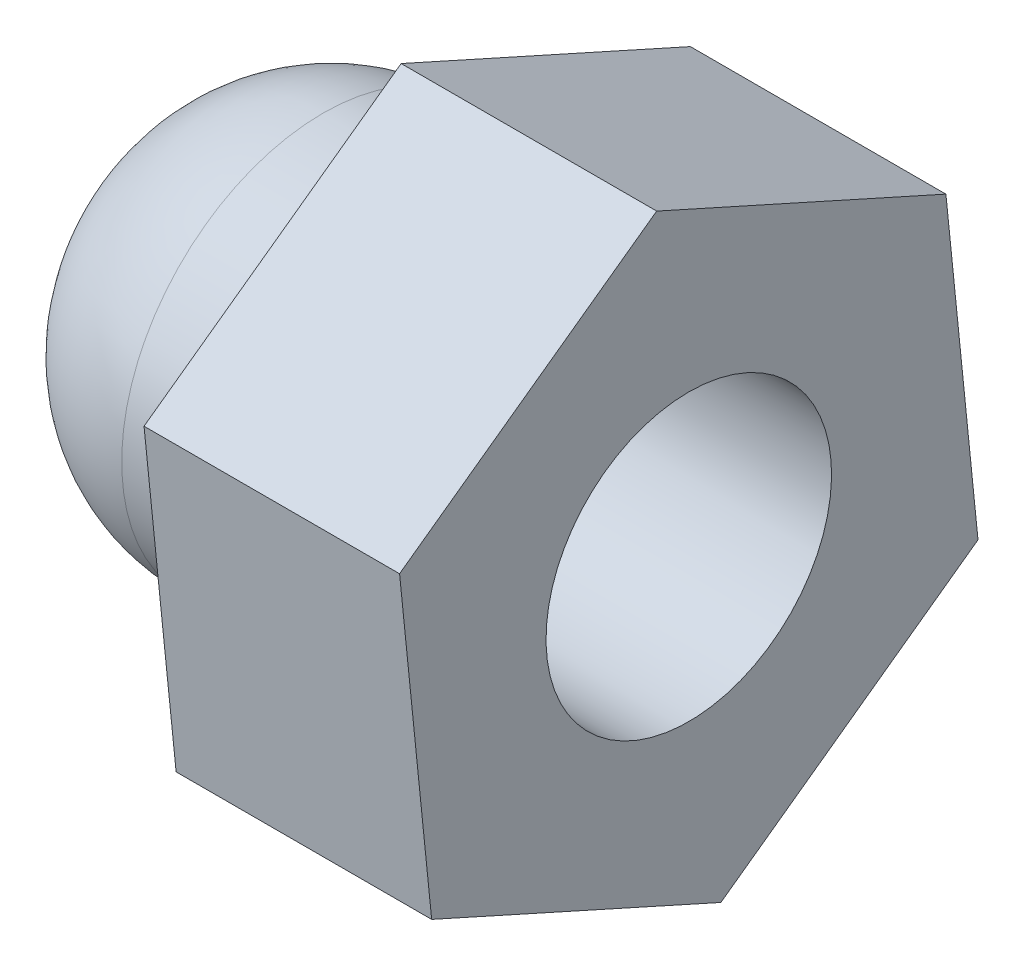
ISO-10303-21;
HEADER;
FILE_DESCRIPTION(('STEP AP214'),'2;1');
FILE_NAME('part.step','',(''),(''),'','','');
FILE_SCHEMA(('AUTOMOTIVE_DESIGN { 1 0 10303 214 1 1 1 1 }'));
ENDSEC;
DATA;
#1=APPLICATION_CONTEXT('core data for automotive mechanical design processes');
#2=APPLICATION_PROTOCOL_DEFINITION('international standard','automotive_design',2000,#1);
#3=PRODUCT_CONTEXT('',#1,'mechanical');
#4=PRODUCT('Part','Part','',(#3));
#5=PRODUCT_RELATED_PRODUCT_CATEGORY('part','',(#4));
#6=PRODUCT_DEFINITION_FORMATION('','',#4);
#7=PRODUCT_DEFINITION_CONTEXT('part definition',#1,'design');
#8=PRODUCT_DEFINITION('design','',#6,#7);
#9=PRODUCT_DEFINITION_SHAPE('','',#8);
#10=(LENGTH_UNIT() NAMED_UNIT(*) SI_UNIT(.MILLI.,.METRE.));
#11=(NAMED_UNIT(*) PLANE_ANGLE_UNIT() SI_UNIT($,.RADIAN.));
#12=(NAMED_UNIT(*) SI_UNIT($,.STERADIAN.) SOLID_ANGLE_UNIT());
#13=UNCERTAINTY_MEASURE_WITH_UNIT(LENGTH_MEASURE(1.E-05),#10,'distance_accuracy_value','');
#14=(GEOMETRIC_REPRESENTATION_CONTEXT(3) GLOBAL_UNCERTAINTY_ASSIGNED_CONTEXT((#13)) GLOBAL_UNIT_ASSIGNED_CONTEXT((#10,
#11,#12)) REPRESENTATION_CONTEXT('',''));
#15=CARTESIAN_POINT('',(0.,0.,0.));
#16=DIRECTION('',(0.,0.,1.));
#17=DIRECTION('',(1.,0.,0.));
#18=AXIS2_PLACEMENT_3D('',#15,#16,#17);
#19=CARTESIAN_POINT('',(1769.87503334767,2148.17169398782,1.72917236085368E-11));
#20=DIRECTION('',(-1.,0.,0.));
#21=DIRECTION('',(0.,-1.,0.));
#22=AXIS2_PLACEMENT_3D('',#19,#20,#21);
#23=DEGENERATE_TOROIDAL_SURFACE('',#22,0.499999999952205,4.99999999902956,.T.);
#24=CARTESIAN_POINT('',(1764.88091590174,2148.17169398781,2.04697370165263E-11));
#25=DIRECTION('',(-1.,0.,0.));
#26=DIRECTION('',(0.,-1.,0.));
#27=AXIS2_PLACEMENT_3D('',#24,#25,#26);
#28=CIRCLE('',#27,0.742468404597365);
#29=CARTESIAN_POINT('',(1764.88091590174,2147.42922558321,2.04643790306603E-11));
#30=VERTEX_POINT('',#29);
#31=EDGE_CURVE('E11',#30,#30,#28,.T.);
#32=ORIENTED_EDGE('',*,*,#31,.F.);
#33=EDGE_LOOP('',(#32));
#34=FACE_BOUND('',#33,.T.);
#35=CARTESIAN_POINT('',(1769.87503334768,2148.17169398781,1.08246744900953E-11));
#36=DIRECTION('',(-1.,0.,0.));
#37=DIRECTION('',(0.,-1.,0.));
#38=AXIS2_PLACEMENT_3D('',#35,#36,#37);
#39=CIRCLE('',#38,5.49999999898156);
#40=CARTESIAN_POINT('',(1769.87503334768,2142.67169398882,1.07849840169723E-11));
#41=VERTEX_POINT('',#40);
#42=EDGE_CURVE('E24',#41,#41,#39,.T.);
#43=ORIENTED_EDGE('',*,*,#42,.T.);
#44=EDGE_LOOP('',(#43));
#45=FACE_BOUND('',#44,.T.);
#46=ADVANCED_FACE('F16',(#34,#45),#23,.T.);
#47=CARTESIAN_POINT('',(1780.17352451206,2148.17169398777,2.14828155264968E-11));
#48=DIRECTION('',(-1.,0.,0.));
#49=DIRECTION('',(0.,1.,0.));
#50=AXIS2_PLACEMENT_3D('',#47,#48,#49);
#51=SPHERICAL_SURFACE('',#50,15.3106217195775);
#52=ORIENTED_EDGE('',*,*,#31,.T.);
#53=EDGE_LOOP('',(#52));
#54=FACE_BOUND('',#53,.T.);
#55=ADVANCED_FACE('F180',(#54),#51,.T.);
#56=CARTESIAN_POINT('',(1762.25339732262,2148.17169398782,2.04142258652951E-11));
#57=DIRECTION('',(-1.,0.,0.));
#58=DIRECTION('',(0.,-1.,0.));
#59=AXIS2_PLACEMENT_3D('',#56,#57,#58);
#60=CYLINDRICAL_SURFACE('',#59,5.49999999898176);
#61=ORIENTED_EDGE('',*,*,#42,.F.);
#62=EDGE_LOOP('',(#61));
#63=FACE_BOUND('',#62,.T.);
#64=CARTESIAN_POINT('',(1772.88488785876,2148.17169398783,1.93178806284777E-11));
#65=DIRECTION('',(-1.,1.0190239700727E-13,0.));
#66=DIRECTION('',(-1.03114200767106E-13,-1.,0.));
#67=AXIS2_PLACEMENT_3D('',#64,#65,#66);
#68=CIRCLE('',#67,5.49999999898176);
#69=CARTESIAN_POINT('',(1772.88488785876,2142.67169398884,1.92827698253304E-11));
#70=VERTEX_POINT('',#69);
#71=EDGE_CURVE('E89',#70,#70,#68,.T.);
#72=ORIENTED_EDGE('',*,*,#71,.T.);
#73=EDGE_LOOP('',(#72));
#74=FACE_BOUND('',#73,.T.);
#75=ADVANCED_FACE('F185',(#63,#74),#60,.T.);
#76=CARTESIAN_POINT('',(1772.88488785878,2134.48876715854,6.14634146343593));
#77=DIRECTION('',(-1.,1.0190239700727E-13,0.));
#78=DIRECTION('',(-1.03114200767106E-13,-1.,0.));
#79=AXIS2_PLACEMENT_3D('',#76,#77,#78);
#80=PLANE('',#79);
#81=DIRECTION('',(0.,0.585106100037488,-0.810956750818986));
#82=VECTOR('',#81,1.);
#83=CARTESIAN_POINT('',(1772.88488785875,2139.55593462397,-0.876750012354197));
#84=LINE('',#83,#82);
#85=CARTESIAN_POINT('',(1772.88488785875,2139.55593462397,-0.876750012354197));
#86=VERTEX_POINT('',#85);
#87=CARTESIAN_POINT('',(1772.88488785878,2144.62310208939,-7.89984148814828));
#88=VERTEX_POINT('',#87);
#89=EDGE_CURVE('E76',#86,#88,#84,.T.);
#90=ORIENTED_EDGE('',*,*,#89,.F.);
#91=DIRECTION('',(0.,-0.409756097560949,-0.912195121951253));
#92=VECTOR('',#91,1.);
#93=CARTESIAN_POINT('',(1772.88488785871,2143.10452652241,7.02309147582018));
#94=LINE('',#93,#92);
#95=CARTESIAN_POINT('',(1772.88488785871,2143.10452652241,7.02309147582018));
#96=VERTEX_POINT('',#95);
#97=EDGE_CURVE('E106',#96,#86,#94,.T.);
#98=ORIENTED_EDGE('',*,*,#97,.F.);
#99=DIRECTION('',(-1.02934399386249E-13,-0.994862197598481,-0.101238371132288));
#100=VECTOR('',#99,1.);
#101=CARTESIAN_POINT('',(1772.88488785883,2151.72028588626,7.89984148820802));
#102=LINE('',#101,#100);
#103=CARTESIAN_POINT('',(1772.88488785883,2151.72028588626,7.89984148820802));
#104=VERTEX_POINT('',#103);
#105=EDGE_CURVE('E104',#104,#96,#102,.T.);
#106=ORIENTED_EDGE('',*,*,#105,.F.);
#107=DIRECTION('',(0.,-0.585106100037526,0.810956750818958));
#108=VECTOR('',#107,1.);
#109=CARTESIAN_POINT('',(1772.88488785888,2156.78745335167,0.876750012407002));
#110=LINE('',#109,#108);
#111=CARTESIAN_POINT('',(1772.88488785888,2156.78745335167,0.876750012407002));
#112=VERTEX_POINT('',#111);
#113=EDGE_CURVE('E102',#112,#104,#110,.T.);
#114=ORIENTED_EDGE('',*,*,#113,.F.);
#115=DIRECTION('',(0.,0.409756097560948,0.912195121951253));
#116=VECTOR('',#115,1.);
#117=CARTESIAN_POINT('',(1772.88488785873,2153.23886145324,-7.0230914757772));
#118=LINE('',#117,#116);
#119=CARTESIAN_POINT('',(1772.88488785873,2153.23886145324,-7.0230914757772));
#120=VERTEX_POINT('',#119);
#121=EDGE_CURVE('E78',#120,#112,#118,.T.);
#122=ORIENTED_EDGE('',*,*,#121,.F.);
#123=DIRECTION('',(0.,0.994862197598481,0.101238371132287));
#124=VECTOR('',#123,1.);
#125=CARTESIAN_POINT('',(1772.88488785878,2144.62310208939,-7.89984148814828));
#126=LINE('',#125,#124);
#127=EDGE_CURVE('E70',#88,#120,#126,.T.);
#128=ORIENTED_EDGE('',*,*,#127,.F.);
#129=EDGE_LOOP('',(#90,#98,#106,#114,#122,#128));
#130=FACE_BOUND('',#129,.T.);
#131=ORIENTED_EDGE('',*,*,#71,.F.);
#132=EDGE_LOOP('',(#131));
#133=FACE_BOUND('',#132,.T.);
#134=ADVANCED_FACE('F72',(#130,#133),#80,.T.);
#135=CARTESIAN_POINT('',(1779.86488785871,2139.55593462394,-0.876750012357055));
#136=DIRECTION('',(0.,0.810956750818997,0.585106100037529));
#137=DIRECTION('',(0.,-0.585106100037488,0.810956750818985));
#138=AXIS2_PLACEMENT_3D('',#135,#136,#137);
#139=PLANE('',#138);
#140=ORIENTED_EDGE('',*,*,#89,.T.);
#141=DIRECTION('',(-1.,0.,0.));
#142=VECTOR('',#141,1.);
#143=CARTESIAN_POINT('',(1779.86488785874,2144.62310208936,-7.89984148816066));
#144=LINE('',#143,#142);
#145=CARTESIAN_POINT('',(1779.86488785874,2144.62310208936,-7.89984148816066));
#146=VERTEX_POINT('',#145);
#147=EDGE_CURVE('E84',#146,#88,#144,.T.);
#148=ORIENTED_EDGE('',*,*,#147,.F.);
#149=DIRECTION('',(0.,0.585106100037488,-0.810956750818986));
#150=VECTOR('',#149,1.);
#151=CARTESIAN_POINT('',(1779.86488785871,2139.55593462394,-0.876750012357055));
#152=LINE('',#151,#150);
#153=CARTESIAN_POINT('',(1779.86488785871,2139.55593462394,-0.876750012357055));
#154=VERTEX_POINT('',#153);
#155=EDGE_CURVE('E108',#154,#146,#152,.T.);
#156=ORIENTED_EDGE('',*,*,#155,.F.);
#157=DIRECTION('',(-1.,0.,0.));
#158=VECTOR('',#157,1.);
#159=CARTESIAN_POINT('',(1779.86488785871,2139.55593462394,-0.876750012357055));
#160=LINE('',#159,#158);
#161=EDGE_CURVE('E94',#154,#86,#160,.T.);
#162=ORIENTED_EDGE('',*,*,#161,.T.);
#163=EDGE_LOOP('',(#140,#148,#156,#162));
#164=FACE_BOUND('',#163,.T.);
#165=ADVANCED_FACE('F93',(#164),#139,.F.);
#166=CARTESIAN_POINT('',(1779.86488785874,2144.62310208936,-7.89984148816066));
#167=DIRECTION('',(0.,-0.101238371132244,0.99486219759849));
#168=DIRECTION('',(0.,-0.994862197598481,-0.101238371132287));
#169=AXIS2_PLACEMENT_3D('',#166,#167,#168);
#170=PLANE('',#169);
#171=ORIENTED_EDGE('',*,*,#127,.T.);
#172=DIRECTION('',(-1.,0.,0.));
#173=VECTOR('',#172,1.);
#174=CARTESIAN_POINT('',(1779.86488785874,2153.23886145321,-7.02309147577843));
#175=LINE('',#174,#173);
#176=CARTESIAN_POINT('',(1779.86488785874,2153.23886145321,-7.02309147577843));
#177=VERTEX_POINT('',#176);
#178=EDGE_CURVE('E90',#177,#120,#175,.T.);
#179=ORIENTED_EDGE('',*,*,#178,.F.);
#180=DIRECTION('',(0.,0.994862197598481,0.101238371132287));
#181=VECTOR('',#180,1.);
#182=CARTESIAN_POINT('',(1779.86488785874,2144.62310208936,-7.89984148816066));
#183=LINE('',#182,#181);
#184=EDGE_CURVE('E86',#146,#177,#183,.T.);
#185=ORIENTED_EDGE('',*,*,#184,.F.);
#186=ORIENTED_EDGE('',*,*,#147,.T.);
#187=EDGE_LOOP('',(#171,#179,#185,#186));
#188=FACE_BOUND('',#187,.T.);
#189=ADVANCED_FACE('F85',(#188),#170,.F.);
#190=CARTESIAN_POINT('',(1779.86488785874,2153.23886145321,-7.02309147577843));
#191=DIRECTION('',(0.,-0.912195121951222,0.409756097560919));
#192=DIRECTION('',(0.,-0.409756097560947,-0.912195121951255));
#193=AXIS2_PLACEMENT_3D('',#190,#191,#192);
#194=PLANE('',#193);
#195=ORIENTED_EDGE('',*,*,#121,.T.);
#196=DIRECTION('',(-1.,0.,0.));
#197=VECTOR('',#196,1.);
#198=CARTESIAN_POINT('',(1779.86488785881,2156.78745335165,0.876750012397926));
#199=LINE('',#198,#197);
#200=CARTESIAN_POINT('',(1779.86488785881,2156.78745335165,0.876750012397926));
#201=VERTEX_POINT('',#200);
#202=EDGE_CURVE('E124',#201,#112,#199,.T.);
#203=ORIENTED_EDGE('',*,*,#202,.F.);
#204=DIRECTION('',(0.,0.409756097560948,0.912195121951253));
#205=VECTOR('',#204,1.);
#206=CARTESIAN_POINT('',(1779.86488785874,2153.23886145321,-7.02309147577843));
#207=LINE('',#206,#205);
#208=EDGE_CURVE('E111',#177,#201,#207,.T.);
#209=ORIENTED_EDGE('',*,*,#208,.F.);
#210=ORIENTED_EDGE('',*,*,#178,.T.);
#211=EDGE_LOOP('',(#195,#203,#209,#210));
#212=FACE_BOUND('',#211,.T.);
#213=ADVANCED_FACE('F163',(#212),#194,.F.);
#214=CARTESIAN_POINT('',(1779.86488785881,2156.78745335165,0.876750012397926));
#215=DIRECTION('',(0.,-0.810956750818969,-0.585106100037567));
#216=DIRECTION('',(0.,0.585106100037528,-0.810956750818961));
#217=AXIS2_PLACEMENT_3D('',#214,#215,#216);
#218=PLANE('',#217);
#219=ORIENTED_EDGE('',*,*,#113,.T.);
#220=DIRECTION('',(-1.,0.,0.));
#221=VECTOR('',#220,1.);
#222=CARTESIAN_POINT('',(1779.86488785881,2151.72028588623,7.89984148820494));
#223=LINE('',#222,#221);
#224=CARTESIAN_POINT('',(1779.86488785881,2151.72028588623,7.89984148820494));
#225=VERTEX_POINT('',#224);
#226=EDGE_CURVE('E121',#225,#104,#223,.T.);
#227=ORIENTED_EDGE('',*,*,#226,.F.);
#228=DIRECTION('',(0.,-0.585106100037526,0.810956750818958));
#229=VECTOR('',#228,1.);
#230=CARTESIAN_POINT('',(1779.86488785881,2156.78745335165,0.876750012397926));
#231=LINE('',#230,#229);
#232=EDGE_CURVE('E113',#201,#225,#231,.T.);
#233=ORIENTED_EDGE('',*,*,#232,.F.);
#234=ORIENTED_EDGE('',*,*,#202,.T.);
#235=EDGE_LOOP('',(#219,#227,#233,#234));
#236=FACE_BOUND('',#235,.T.);
#237=ADVANCED_FACE('F167',(#236),#218,.F.);
#238=CARTESIAN_POINT('',(1779.86488785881,2151.72028588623,7.89984148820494));
#239=DIRECTION('',(0.,0.101238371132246,-0.99486219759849));
#240=DIRECTION('',(0.,0.994862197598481,0.101238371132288));
#241=AXIS2_PLACEMENT_3D('',#238,#239,#240);
#242=PLANE('',#241);
#243=ORIENTED_EDGE('',*,*,#105,.T.);
#244=DIRECTION('',(-1.,0.,0.));
#245=VECTOR('',#244,1.);
#246=CARTESIAN_POINT('',(1779.8648878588,2143.10452652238,7.02309147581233));
#247=LINE('',#246,#245);
#248=CARTESIAN_POINT('',(1779.8648878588,2143.10452652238,7.02309147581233));
#249=VERTEX_POINT('',#248);
#250=EDGE_CURVE('E118',#249,#96,#247,.T.);
#251=ORIENTED_EDGE('',*,*,#250,.F.);
#252=DIRECTION('',(-1.02934399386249E-13,-0.994862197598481,-0.101238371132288));
#253=VECTOR('',#252,1.);
#254=CARTESIAN_POINT('',(1779.86488785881,2151.72028588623,7.89984148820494));
#255=LINE('',#254,#253);
#256=EDGE_CURVE('E37',#225,#249,#255,.T.);
#257=ORIENTED_EDGE('',*,*,#256,.F.);
#258=ORIENTED_EDGE('',*,*,#226,.T.);
#259=EDGE_LOOP('',(#243,#251,#257,#258));
#260=FACE_BOUND('',#259,.T.);
#261=ADVANCED_FACE('F170',(#260),#242,.F.);
#262=CARTESIAN_POINT('',(1779.8648878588,2143.10452652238,7.02309147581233));
#263=DIRECTION('',(0.,0.912195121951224,-0.409756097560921));
#264=DIRECTION('',(0.,0.409756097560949,0.912195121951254));
#265=AXIS2_PLACEMENT_3D('',#262,#263,#264);
#266=PLANE('',#265);
#267=ORIENTED_EDGE('',*,*,#97,.T.);
#268=ORIENTED_EDGE('',*,*,#161,.F.);
#269=DIRECTION('',(0.,-0.409756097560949,-0.912195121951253));
#270=VECTOR('',#269,1.);
#271=CARTESIAN_POINT('',(1779.8648878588,2143.10452652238,7.02309147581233));
#272=LINE('',#271,#270);
#273=EDGE_CURVE('E32',#249,#154,#272,.T.);
#274=ORIENTED_EDGE('',*,*,#273,.F.);
#275=ORIENTED_EDGE('',*,*,#250,.T.);
#276=EDGE_LOOP('',(#267,#268,#274,#275));
#277=FACE_BOUND('',#276,.T.);
#278=ADVANCED_FACE('F158',(#277),#266,.F.);
#279=CARTESIAN_POINT('',(1779.86488785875,2134.48876715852,6.14634146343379));
#280=DIRECTION('',(-1.,1.0190239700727E-13,0.));
#281=DIRECTION('',(-1.03114200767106E-13,-1.,0.));
#282=AXIS2_PLACEMENT_3D('',#279,#280,#281);
#283=PLANE('',#282);
#284=CARTESIAN_POINT('',(1779.86488785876,2148.1716939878,7.48012762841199E-12));
#285=DIRECTION('',(1.,-1.0190239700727E-13,0.));
#286=DIRECTION('',(1.03114200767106E-13,1.,0.));
#287=AXIS2_PLACEMENT_3D('',#284,#285,#286);
#288=CIRCLE('',#287,3.9);
#289=CARTESIAN_POINT('',(1779.86488785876,2152.0716939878,7.50502437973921E-12));
#290=VERTEX_POINT('',#289);
#291=EDGE_CURVE('E147',#290,#290,#288,.T.);
#292=ORIENTED_EDGE('',*,*,#291,.F.);
#293=EDGE_LOOP('',(#292));
#294=FACE_BOUND('',#293,.T.);
#295=ORIENTED_EDGE('',*,*,#155,.T.);
#296=ORIENTED_EDGE('',*,*,#184,.T.);
#297=ORIENTED_EDGE('',*,*,#208,.T.);
#298=ORIENTED_EDGE('',*,*,#232,.T.);
#299=ORIENTED_EDGE('',*,*,#256,.T.);
#300=ORIENTED_EDGE('',*,*,#273,.T.);
#301=EDGE_LOOP('',(#295,#296,#297,#298,#299,#300));
#302=FACE_BOUND('',#301,.T.);
#303=ADVANCED_FACE('F156',(#294,#302),#283,.F.);
#304=CARTESIAN_POINT('',(1767.86488785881,2148.17169398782,2.3189783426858E-11));
#305=DIRECTION('',(1.,-1.0190239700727E-13,0.));
#306=DIRECTION('',(1.03114200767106E-13,1.,0.));
#307=AXIS2_PLACEMENT_3D('',#304,#305,#306);
#308=CYLINDRICAL_SURFACE('',#307,3.9);
#309=CARTESIAN_POINT('',(1772.88488785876,2148.17169398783,1.93178806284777E-11));
#310=DIRECTION('',(-1.,1.0190239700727E-13,0.));
#311=DIRECTION('',(-1.03114200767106E-13,-1.,0.));
#312=AXIS2_PLACEMENT_3D('',#309,#310,#311);
#313=CIRCLE('',#312,3.9);
#314=CARTESIAN_POINT('',(1772.88488785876,2144.27169398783,1.92929838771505E-11));
#315=VERTEX_POINT('',#314);
#316=EDGE_CURVE('E95',#315,#315,#313,.T.);
#317=ORIENTED_EDGE('',*,*,#316,.T.);
#318=EDGE_LOOP('',(#317));
#319=FACE_BOUND('',#318,.T.);
#320=ORIENTED_EDGE('',*,*,#291,.T.);
#321=EDGE_LOOP('',(#320));
#322=FACE_BOUND('',#321,.T.);
#323=ADVANCED_FACE('F154',(#319,#322),#308,.F.);
#324=ORIENTED_EDGE('',*,*,#316,.F.);
#325=EDGE_LOOP('',(#324));
#326=FACE_BOUND('',#325,.T.);
#327=CARTESIAN_POINT('',(1772.88488785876,2148.17169398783,1.93178806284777E-11));
#328=DIRECTION('',(-1.,0.,0.));
#329=DIRECTION('',(0.,-1.,0.));
#330=AXIS2_PLACEMENT_3D('',#327,#328,#329);
#331=CIRCLE('',#330,3.99999999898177);
#332=CARTESIAN_POINT('',(1772.88488785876,2144.17169398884,1.92890148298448E-11));
#333=VERTEX_POINT('',#332);
#334=EDGE_CURVE('E134',#333,#333,#331,.T.);
#335=ORIENTED_EDGE('',*,*,#334,.T.);
#336=EDGE_LOOP('',(#335));
#337=FACE_BOUND('',#336,.T.);
#338=ADVANCED_FACE('F197',(#326,#337),#80,.T.);
#339=CARTESIAN_POINT('',(1769.87503334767,2148.17169398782,1.72917236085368E-11));
#340=DIRECTION('',(-1.,0.,0.));
#341=DIRECTION('',(0.,-1.,0.));
#342=AXIS2_PLACEMENT_3D('',#339,#340,#341);
#343=DEGENERATE_TOROIDAL_SURFACE('',#342,0.499999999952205,3.49999999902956,.T.);
#344=CARTESIAN_POINT('',(1769.04437096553,2148.17169398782,2.68951527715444E-11));
#345=DIRECTION('',(1.,0.,0.));
#346=DIRECTION('',(0.,1.,0.));
#347=AXIS2_PLACEMENT_3D('',#344,#345,#346);
#348=CIRCLE('',#347,3.9);
#349=CARTESIAN_POINT('',(1769.04437096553,2152.07169398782,2.69232969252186E-11));
#350=VERTEX_POINT('',#349);
#351=EDGE_CURVE('E19',#350,#350,#348,.T.);
#352=ORIENTED_EDGE('',*,*,#351,.F.);
#353=EDGE_LOOP('',(#352));
#354=FACE_BOUND('',#353,.T.);
#355=CARTESIAN_POINT('',(1769.87503334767,2148.17169398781,1.0019762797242E-11));
#356=DIRECTION('',(-1.,0.,0.));
#357=DIRECTION('',(0.,-1.,0.));
#358=AXIS2_PLACEMENT_3D('',#355,#356,#357);
#359=CIRCLE('',#358,3.99999999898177);
#360=CARTESIAN_POINT('',(1769.87503334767,2144.17169398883,9.99089699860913E-12));
#361=VERTEX_POINT('',#360);
#362=EDGE_CURVE('E130',#361,#361,#359,.T.);
#363=ORIENTED_EDGE('',*,*,#362,.F.);
#364=EDGE_LOOP('',(#363));
#365=FACE_BOUND('',#364,.T.);
#366=ADVANCED_FACE('F204',(#354,#365),#343,.F.);
#367=CARTESIAN_POINT('',(1762.25339732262,2148.17169398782,2.04142258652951E-11));
#368=DIRECTION('',(-1.,0.,0.));
#369=DIRECTION('',(0.,-1.,0.));
#370=AXIS2_PLACEMENT_3D('',#367,#368,#369);
#371=CYLINDRICAL_SURFACE('',#370,3.99999999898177);
#372=ORIENTED_EDGE('',*,*,#362,.T.);
#373=EDGE_LOOP('',(#372));
#374=FACE_BOUND('',#373,.T.);
#375=ORIENTED_EDGE('',*,*,#334,.F.);
#376=EDGE_LOOP('',(#375));
#377=FACE_BOUND('',#376,.T.);
#378=ADVANCED_FACE('F210',(#374,#377),#371,.F.);
#379=CARTESIAN_POINT('',(1767.86488785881,2148.17169398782,2.3189783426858E-11));
#380=DIRECTION('',(1.,-1.0190239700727E-13,0.));
#381=DIRECTION('',(1.03114200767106E-13,1.,0.));
#382=AXIS2_PLACEMENT_3D('',#379,#380,#381);
#383=PLANE('',#382);
#384=CARTESIAN_POINT('',(1767.86488785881,2148.17169398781,2.0566881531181E-11));
#385=DIRECTION('',(1.,-1.0190239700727E-13,0.));
#386=DIRECTION('',(1.03114200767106E-13,1.,0.));
#387=AXIS2_PLACEMENT_3D('',#384,#385,#386);
#388=CIRCLE('',#387,3.3651902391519);
#389=CARTESIAN_POINT('',(1767.86488785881,2151.53688422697,2.05883641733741E-11));
#390=VERTEX_POINT('',#389);
#391=EDGE_CURVE('E140',#390,#390,#388,.T.);
#392=ORIENTED_EDGE('',*,*,#391,.F.);
#393=EDGE_LOOP('',(#392));
#394=FACE_BOUND('',#393,.T.);
#395=CARTESIAN_POINT('',(1767.86488785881,2148.17169398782,2.3189783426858E-11));
#396=DIRECTION('',(1.,-1.0190239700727E-13,0.));
#397=DIRECTION('',(1.03114200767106E-13,1.,0.));
#398=AXIS2_PLACEMENT_3D('',#395,#396,#397);
#399=CIRCLE('',#398,3.9);
#400=CARTESIAN_POINT('',(1767.86488785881,2152.07169398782,2.32146801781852E-11));
#401=VERTEX_POINT('',#400);
#402=EDGE_CURVE('E142',#401,#401,#399,.T.);
#403=ORIENTED_EDGE('',*,*,#402,.T.);
#404=EDGE_LOOP('',(#403));
#405=FACE_BOUND('',#404,.T.);
#406=ADVANCED_FACE('F221',(#394,#405),#383,.T.);
#407=ORIENTED_EDGE('',*,*,#351,.T.);
#408=EDGE_LOOP('',(#407));
#409=FACE_BOUND('',#408,.T.);
#410=ORIENTED_EDGE('',*,*,#402,.F.);
#411=EDGE_LOOP('',(#410));
#412=FACE_BOUND('',#411,.T.);
#413=ADVANCED_FACE('F215',(#409,#412),#308,.F.);
#414=CARTESIAN_POINT('',(1780.17352451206,2148.17169398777,2.14828155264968E-11));
#415=DIRECTION('',(-1.,0.,0.));
#416=DIRECTION('',(0.,1.,0.));
#417=AXIS2_PLACEMENT_3D('',#414,#415,#416);
#418=SPHERICAL_SURFACE('',#417,13.8106217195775);
#419=CARTESIAN_POINT('',(1766.37915113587,2148.17169398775,1.29063426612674E-11));
#420=DIRECTION('',(-1.,0.,0.));
#421=DIRECTION('',(0.,-1.,0.));
#422=AXIS2_PLACEMENT_3D('',#419,#420,#421);
#423=CIRCLE('',#422,0.669727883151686);
#424=CARTESIAN_POINT('',(1766.37915113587,2147.5019661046,1.29015096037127E-11));
#425=VERTEX_POINT('',#424);
#426=EDGE_CURVE('E131',#425,#425,#423,.T.);
#427=ORIENTED_EDGE('',*,*,#426,.F.);
#428=EDGE_LOOP('',(#427));
#429=FACE_BOUND('',#428,.T.);
#430=ADVANCED_FACE('F230',(#429),#418,.F.);
#431=ORIENTED_EDGE('',*,*,#426,.T.);
#432=EDGE_LOOP('',(#431));
#433=FACE_BOUND('',#432,.T.);
#434=ORIENTED_EDGE('',*,*,#391,.T.);
#435=EDGE_LOOP('',(#434));
#436=FACE_BOUND('',#435,.T.);
#437=ADVANCED_FACE('F213',(#433,#436),#343,.F.);
#438=CLOSED_SHELL('',(#46,#55,#75,#134,#165,#189,#213,#237,#261,#278,#303,#323,#338,#366,#378,
#406,#413,#430,#437));
#439=MANIFOLD_SOLID_BREP('B1',#438);
#440=ADVANCED_BREP_SHAPE_REPRESENTATION('',(#18,#439),#14);
#441=SHAPE_DEFINITION_REPRESENTATION(#9,#440);
ENDSEC;
END-ISO-10303-21;
